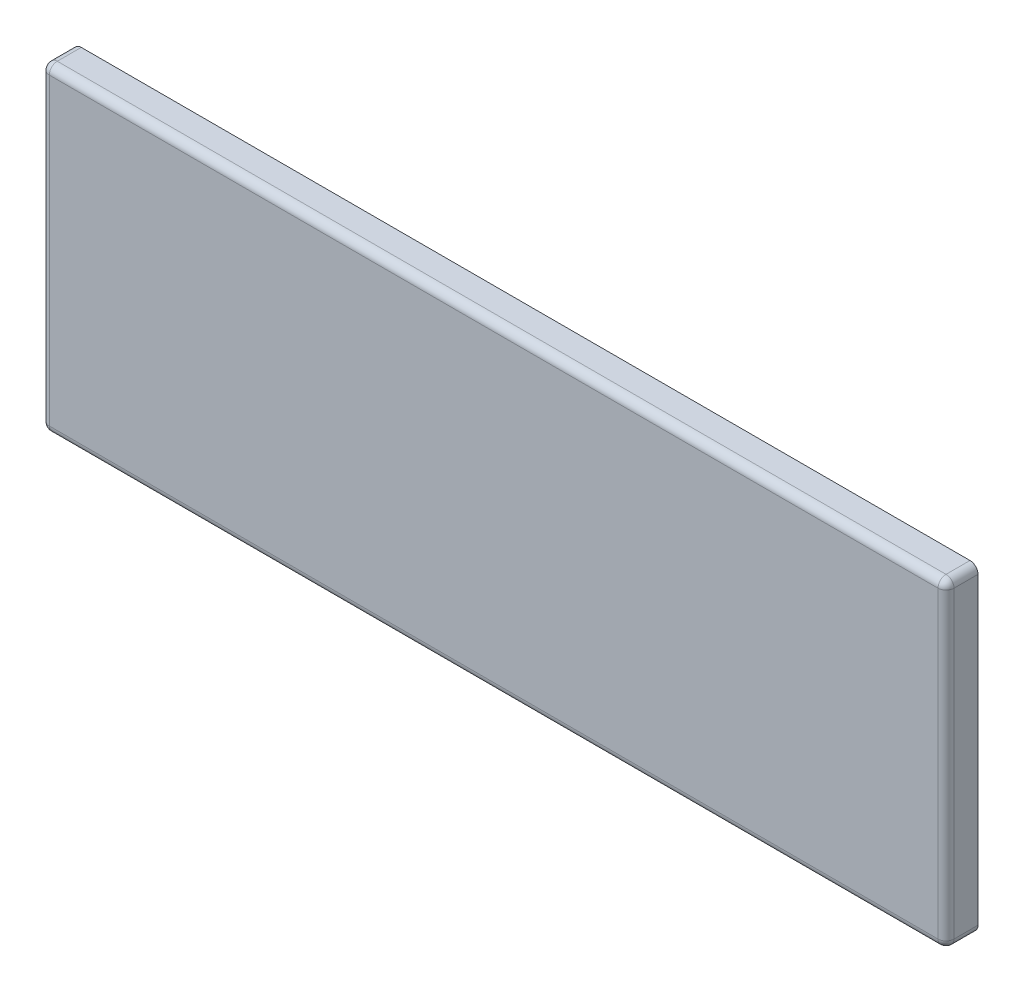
ISO-10303-21;
HEADER;
FILE_DESCRIPTION(('STEP AP214'),'2;1');
FILE_NAME('part.step','',(''),(''),'','','');
FILE_SCHEMA(('AUTOMOTIVE_DESIGN { 1 0 10303 214 1 1 1 1 }'));
ENDSEC;
DATA;
#1=APPLICATION_CONTEXT('core data for automotive mechanical design processes');
#2=APPLICATION_PROTOCOL_DEFINITION('international standard','automotive_design',2000,#1);
#3=PRODUCT_CONTEXT('',#1,'mechanical');
#4=PRODUCT('Part','Part','',(#3));
#5=PRODUCT_RELATED_PRODUCT_CATEGORY('part','',(#4));
#6=PRODUCT_DEFINITION_FORMATION('','',#4);
#7=PRODUCT_DEFINITION_CONTEXT('part definition',#1,'design');
#8=PRODUCT_DEFINITION('design','',#6,#7);
#9=PRODUCT_DEFINITION_SHAPE('','',#8);
#10=(LENGTH_UNIT() NAMED_UNIT(*) SI_UNIT(.MILLI.,.METRE.));
#11=(NAMED_UNIT(*) PLANE_ANGLE_UNIT() SI_UNIT($,.RADIAN.));
#12=(NAMED_UNIT(*) SI_UNIT($,.STERADIAN.) SOLID_ANGLE_UNIT());
#13=UNCERTAINTY_MEASURE_WITH_UNIT(LENGTH_MEASURE(1.E-05),#10,'distance_accuracy_value','');
#14=(GEOMETRIC_REPRESENTATION_CONTEXT(3) GLOBAL_UNCERTAINTY_ASSIGNED_CONTEXT((#13)) GLOBAL_UNIT_ASSIGNED_CONTEXT((#10,
#11,#12)) REPRESENTATION_CONTEXT('',''));
#15=CARTESIAN_POINT('',(0.,0.,0.));
#16=DIRECTION('',(0.,0.,1.));
#17=DIRECTION('',(1.,0.,0.));
#18=AXIS2_PLACEMENT_3D('',#15,#16,#17);
#19=CARTESIAN_POINT('',(56.57,-20.,4.));
#20=DIRECTION('',(-1.,0.,0.));
#21=DIRECTION('',(0.,0.,1.));
#22=AXIS2_PLACEMENT_3D('',#19,#20,#21);
#23=PLANE('',#22);
#24=DIRECTION('',(0.,1.,0.));
#25=VECTOR('',#24,1.);
#26=CARTESIAN_POINT('',(56.57,-20.,3.));
#27=LINE('',#26,#25);
#28=CARTESIAN_POINT('',(56.57,19.,3.));
#29=VERTEX_POINT('',#28);
#30=CARTESIAN_POINT('',(56.57,-19.,3.));
#31=VERTEX_POINT('',#30);
#32=EDGE_CURVE('E47',#29,#31,#27,.F.);
#33=ORIENTED_EDGE('',*,*,#32,.T.);
#34=DIRECTION('',(0.,0.,-1.));
#35=VECTOR('',#34,1.);
#36=CARTESIAN_POINT('',(56.57,-19.,4.));
#37=LINE('',#36,#35);
#38=CARTESIAN_POINT('',(56.57,-19.,0.));
#39=VERTEX_POINT('',#38);
#40=EDGE_CURVE('E166',#31,#39,#37,.T.);
#41=ORIENTED_EDGE('',*,*,#40,.T.);
#42=DIRECTION('',(0.,1.,0.));
#43=VECTOR('',#42,1.);
#44=CARTESIAN_POINT('',(56.57,-20.,0.));
#45=LINE('',#44,#43);
#46=CARTESIAN_POINT('',(56.57,19.,0.));
#47=VERTEX_POINT('',#46);
#48=EDGE_CURVE('E195',#39,#47,#45,.T.);
#49=ORIENTED_EDGE('',*,*,#48,.T.);
#50=DIRECTION('',(0.,0.,-1.));
#51=VECTOR('',#50,1.);
#52=CARTESIAN_POINT('',(56.57,19.,4.));
#53=LINE('',#52,#51);
#54=EDGE_CURVE('E52',#47,#29,#53,.F.);
#55=ORIENTED_EDGE('',*,*,#54,.T.);
#56=EDGE_LOOP('',(#33,#41,#49,#55));
#57=FACE_BOUND('',#56,.T.);
#58=ADVANCED_FACE('F30',(#57),#23,.F.);
#59=CARTESIAN_POINT('',(56.57,20.,4.));
#60=DIRECTION('',(0.,-1.,0.));
#61=DIRECTION('',(0.,0.,-1.));
#62=AXIS2_PLACEMENT_3D('',#59,#60,#61);
#63=PLANE('',#62);
#64=DIRECTION('',(-1.,0.,0.));
#65=VECTOR('',#64,1.);
#66=CARTESIAN_POINT('',(56.57,20.,0.));
#67=LINE('',#66,#65);
#68=CARTESIAN_POINT('',(55.57,20.,0.));
#69=VERTEX_POINT('',#68);
#70=CARTESIAN_POINT('',(-55.57,20.,0.));
#71=VERTEX_POINT('',#70);
#72=EDGE_CURVE('E197',#69,#71,#67,.T.);
#73=ORIENTED_EDGE('',*,*,#72,.T.);
#74=DIRECTION('',(0.,0.,-1.));
#75=VECTOR('',#74,1.);
#76=CARTESIAN_POINT('',(-55.57,20.,4.));
#77=LINE('',#76,#75);
#78=CARTESIAN_POINT('',(-55.57,20.,3.));
#79=VERTEX_POINT('',#78);
#80=EDGE_CURVE('E162',#71,#79,#77,.F.);
#81=ORIENTED_EDGE('',*,*,#80,.T.);
#82=DIRECTION('',(-1.,0.,0.));
#83=VECTOR('',#82,1.);
#84=CARTESIAN_POINT('',(56.57,20.,3.));
#85=LINE('',#84,#83);
#86=CARTESIAN_POINT('',(55.57,20.,3.));
#87=VERTEX_POINT('',#86);
#88=EDGE_CURVE('E160',#79,#87,#85,.F.);
#89=ORIENTED_EDGE('',*,*,#88,.T.);
#90=DIRECTION('',(0.,0.,-1.));
#91=VECTOR('',#90,1.);
#92=CARTESIAN_POINT('',(55.57,20.,4.));
#93=LINE('',#92,#91);
#94=EDGE_CURVE('E158',#87,#69,#93,.T.);
#95=ORIENTED_EDGE('',*,*,#94,.T.);
#96=EDGE_LOOP('',(#73,#81,#89,#95));
#97=FACE_BOUND('',#96,.T.);
#98=ADVANCED_FACE('F249',(#97),#63,.F.);
#99=CARTESIAN_POINT('',(-56.57,20.,4.));
#100=DIRECTION('',(1.,0.,0.));
#101=DIRECTION('',(0.,1.,0.));
#102=AXIS2_PLACEMENT_3D('',#99,#100,#101);
#103=PLANE('',#102);
#104=DIRECTION('',(0.,-1.,0.));
#105=VECTOR('',#104,1.);
#106=CARTESIAN_POINT('',(-56.57,20.,0.));
#107=LINE('',#106,#105);
#108=CARTESIAN_POINT('',(-56.57,19.,0.));
#109=VERTEX_POINT('',#108);
#110=CARTESIAN_POINT('',(-56.57,-19.,0.));
#111=VERTEX_POINT('',#110);
#112=EDGE_CURVE('E201',#109,#111,#107,.T.);
#113=ORIENTED_EDGE('',*,*,#112,.T.);
#114=DIRECTION('',(0.,0.,-1.));
#115=VECTOR('',#114,1.);
#116=CARTESIAN_POINT('',(-56.57,-19.,4.));
#117=LINE('',#116,#115);
#118=CARTESIAN_POINT('',(-56.57,-19.,3.));
#119=VERTEX_POINT('',#118);
#120=EDGE_CURVE('E156',#111,#119,#117,.F.);
#121=ORIENTED_EDGE('',*,*,#120,.T.);
#122=DIRECTION('',(0.,-1.,0.));
#123=VECTOR('',#122,1.);
#124=CARTESIAN_POINT('',(-56.57,20.,3.));
#125=LINE('',#124,#123);
#126=CARTESIAN_POINT('',(-56.57,19.,3.));
#127=VERTEX_POINT('',#126);
#128=EDGE_CURVE('E154',#119,#127,#125,.F.);
#129=ORIENTED_EDGE('',*,*,#128,.T.);
#130=DIRECTION('',(0.,0.,-1.));
#131=VECTOR('',#130,1.);
#132=CARTESIAN_POINT('',(-56.57,19.,4.));
#133=LINE('',#132,#131);
#134=EDGE_CURVE('E152',#127,#109,#133,.T.);
#135=ORIENTED_EDGE('',*,*,#134,.T.);
#136=EDGE_LOOP('',(#113,#121,#129,#135));
#137=FACE_BOUND('',#136,.T.);
#138=ADVANCED_FACE('F254',(#137),#103,.F.);
#139=CARTESIAN_POINT('',(56.57,-20.,4.));
#140=DIRECTION('',(0.,1.,0.));
#141=DIRECTION('',(0.,0.,1.));
#142=AXIS2_PLACEMENT_3D('',#139,#140,#141);
#143=PLANE('',#142);
#144=DIRECTION('',(1.,0.,0.));
#145=VECTOR('',#144,1.);
#146=CARTESIAN_POINT('',(56.57,-20.,0.));
#147=LINE('',#146,#145);
#148=CARTESIAN_POINT('',(-55.57,-20.,0.));
#149=VERTEX_POINT('',#148);
#150=CARTESIAN_POINT('',(55.57,-20.,0.));
#151=VERTEX_POINT('',#150);
#152=EDGE_CURVE('E137',#149,#151,#147,.T.);
#153=ORIENTED_EDGE('',*,*,#152,.T.);
#154=DIRECTION('',(0.,0.,-1.));
#155=VECTOR('',#154,1.);
#156=CARTESIAN_POINT('',(55.57,-20.,4.));
#157=LINE('',#156,#155);
#158=CARTESIAN_POINT('',(55.57,-20.,3.));
#159=VERTEX_POINT('',#158);
#160=EDGE_CURVE('E150',#151,#159,#157,.F.);
#161=ORIENTED_EDGE('',*,*,#160,.T.);
#162=DIRECTION('',(1.,0.,0.));
#163=VECTOR('',#162,1.);
#164=CARTESIAN_POINT('',(-56.57,-20.,3.));
#165=LINE('',#164,#163);
#166=CARTESIAN_POINT('',(-55.57,-20.,3.));
#167=VERTEX_POINT('',#166);
#168=EDGE_CURVE('E115',#159,#167,#165,.F.);
#169=ORIENTED_EDGE('',*,*,#168,.T.);
#170=DIRECTION('',(0.,0.,-1.));
#171=VECTOR('',#170,1.);
#172=CARTESIAN_POINT('',(-55.57,-20.,4.));
#173=LINE('',#172,#171);
#174=EDGE_CURVE('E143',#167,#149,#173,.T.);
#175=ORIENTED_EDGE('',*,*,#174,.T.);
#176=EDGE_LOOP('',(#153,#161,#169,#175));
#177=FACE_BOUND('',#176,.T.);
#178=ADVANCED_FACE('F226',(#177),#143,.F.);
#179=CARTESIAN_POINT('',(56.57,20.,4.));
#180=DIRECTION('',(0.,0.,1.));
#181=DIRECTION('',(1.,0.,0.));
#182=AXIS2_PLACEMENT_3D('',#179,#180,#181);
#183=PLANE('',#182);
#184=DIRECTION('',(0.,-1.,0.));
#185=VECTOR('',#184,1.);
#186=CARTESIAN_POINT('',(-55.57,-20.,4.));
#187=LINE('',#186,#185);
#188=CARTESIAN_POINT('',(-55.57,19.,4.));
#189=VERTEX_POINT('',#188);
#190=CARTESIAN_POINT('',(-55.57,-19.,4.));
#191=VERTEX_POINT('',#190);
#192=EDGE_CURVE('E141',#189,#191,#187,.T.);
#193=ORIENTED_EDGE('',*,*,#192,.T.);
#194=DIRECTION('',(1.,0.,0.));
#195=VECTOR('',#194,1.);
#196=CARTESIAN_POINT('',(56.57,-19.,4.));
#197=LINE('',#196,#195);
#198=CARTESIAN_POINT('',(55.57,-19.,4.));
#199=VERTEX_POINT('',#198);
#200=EDGE_CURVE('E113',#191,#199,#197,.T.);
#201=ORIENTED_EDGE('',*,*,#200,.T.);
#202=DIRECTION('',(0.,1.,0.));
#203=VECTOR('',#202,1.);
#204=CARTESIAN_POINT('',(55.57,20.,4.));
#205=LINE('',#204,#203);
#206=CARTESIAN_POINT('',(55.57,19.,4.));
#207=VERTEX_POINT('',#206);
#208=EDGE_CURVE('E130',#199,#207,#205,.T.);
#209=ORIENTED_EDGE('',*,*,#208,.T.);
#210=DIRECTION('',(-1.,0.,0.));
#211=VECTOR('',#210,1.);
#212=CARTESIAN_POINT('',(-56.57,19.,4.));
#213=LINE('',#212,#211);
#214=EDGE_CURVE('E136',#207,#189,#213,.T.);
#215=ORIENTED_EDGE('',*,*,#214,.T.);
#216=EDGE_LOOP('',(#193,#201,#209,#215));
#217=FACE_BOUND('',#216,.T.);
#218=ADVANCED_FACE('F139',(#217),#183,.T.);
#219=CARTESIAN_POINT('',(56.57,20.,0.));
#220=DIRECTION('',(0.,0.,1.));
#221=DIRECTION('',(1.,0.,0.));
#222=AXIS2_PLACEMENT_3D('',#219,#220,#221);
#223=PLANE('',#222);
#224=ORIENTED_EDGE('',*,*,#48,.F.);
#225=CARTESIAN_POINT('',(55.57,-19.,0.));
#226=DIRECTION('',(0.,0.,1.));
#227=DIRECTION('',(1.,0.,0.));
#228=AXIS2_PLACEMENT_3D('',#225,#226,#227);
#229=CIRCLE('',#228,1.);
#230=EDGE_CURVE('E11',#39,#151,#229,.F.);
#231=ORIENTED_EDGE('',*,*,#230,.T.);
#232=ORIENTED_EDGE('',*,*,#152,.F.);
#233=CARTESIAN_POINT('',(-55.57,-19.,0.));
#234=DIRECTION('',(0.,0.,1.));
#235=DIRECTION('',(1.,0.,0.));
#236=AXIS2_PLACEMENT_3D('',#233,#234,#235);
#237=CIRCLE('',#236,1.);
#238=EDGE_CURVE('E39',#149,#111,#237,.F.);
#239=ORIENTED_EDGE('',*,*,#238,.T.);
#240=ORIENTED_EDGE('',*,*,#112,.F.);
#241=CARTESIAN_POINT('',(-55.57,19.,0.));
#242=DIRECTION('',(0.,0.,1.));
#243=DIRECTION('',(1.,0.,0.));
#244=AXIS2_PLACEMENT_3D('',#241,#242,#243);
#245=CIRCLE('',#244,1.);
#246=EDGE_CURVE('E170',#109,#71,#245,.F.);
#247=ORIENTED_EDGE('',*,*,#246,.T.);
#248=ORIENTED_EDGE('',*,*,#72,.F.);
#249=CARTESIAN_POINT('',(55.57,19.,0.));
#250=DIRECTION('',(0.,0.,1.));
#251=DIRECTION('',(1.,0.,0.));
#252=AXIS2_PLACEMENT_3D('',#249,#250,#251);
#253=CIRCLE('',#252,1.);
#254=EDGE_CURVE('E168',#69,#47,#253,.F.);
#255=ORIENTED_EDGE('',*,*,#254,.T.);
#256=EDGE_LOOP('',(#224,#231,#232,#239,#240,#247,#248,#255));
#257=FACE_BOUND('',#256,.T.);
#258=ADVANCED_FACE('F232',(#257),#223,.F.);
#259=CARTESIAN_POINT('',(-55.57,19.,4.));
#260=DIRECTION('',(0.,0.,-1.));
#261=DIRECTION('',(-1.,0.,0.));
#262=AXIS2_PLACEMENT_3D('',#259,#260,#261);
#263=CYLINDRICAL_SURFACE('',#262,1.);
#264=ORIENTED_EDGE('',*,*,#246,.F.);
#265=ORIENTED_EDGE('',*,*,#134,.F.);
#266=CARTESIAN_POINT('',(-55.57,19.,3.));
#267=DIRECTION('',(0.,0.,1.));
#268=DIRECTION('',(1.,0.,0.));
#269=AXIS2_PLACEMENT_3D('',#266,#267,#268);
#270=CIRCLE('',#269,1.);
#271=EDGE_CURVE('E34',#79,#127,#270,.T.);
#272=ORIENTED_EDGE('',*,*,#271,.F.);
#273=ORIENTED_EDGE('',*,*,#80,.F.);
#274=EDGE_LOOP('',(#264,#265,#272,#273));
#275=FACE_BOUND('',#274,.T.);
#276=ADVANCED_FACE('F32',(#275),#263,.T.);
#277=CARTESIAN_POINT('',(56.57,19.,3.));
#278=DIRECTION('',(1.,0.,0.));
#279=DIRECTION('',(0.,0.,-1.));
#280=AXIS2_PLACEMENT_3D('',#277,#278,#279);
#281=CYLINDRICAL_SURFACE('',#280,1.);
#282=CARTESIAN_POINT('',(55.57,19.,3.));
#283=DIRECTION('',(1.,0.,0.));
#284=DIRECTION('',(0.,0.,-1.));
#285=AXIS2_PLACEMENT_3D('',#282,#283,#284);
#286=CIRCLE('',#285,1.);
#287=EDGE_CURVE('E187',#87,#207,#286,.T.);
#288=ORIENTED_EDGE('',*,*,#287,.F.);
#289=ORIENTED_EDGE('',*,*,#88,.F.);
#290=CARTESIAN_POINT('',(-55.57,19.,3.));
#291=DIRECTION('',(-1.,0.,0.));
#292=DIRECTION('',(0.,-1.,0.));
#293=AXIS2_PLACEMENT_3D('',#290,#291,#292);
#294=CIRCLE('',#293,1.);
#295=EDGE_CURVE('E189',#189,#79,#294,.T.);
#296=ORIENTED_EDGE('',*,*,#295,.F.);
#297=ORIENTED_EDGE('',*,*,#214,.F.);
#298=EDGE_LOOP('',(#288,#289,#296,#297));
#299=FACE_BOUND('',#298,.T.);
#300=ADVANCED_FACE('F210',(#299),#281,.T.);
#301=CARTESIAN_POINT('',(55.57,19.,4.));
#302=DIRECTION('',(0.,0.,-1.));
#303=DIRECTION('',(-1.,0.,0.));
#304=AXIS2_PLACEMENT_3D('',#301,#302,#303);
#305=CYLINDRICAL_SURFACE('',#304,1.);
#306=ORIENTED_EDGE('',*,*,#254,.F.);
#307=ORIENTED_EDGE('',*,*,#94,.F.);
#308=CARTESIAN_POINT('',(55.57,19.,3.));
#309=DIRECTION('',(0.,0.,1.));
#310=DIRECTION('',(1.,0.,0.));
#311=AXIS2_PLACEMENT_3D('',#308,#309,#310);
#312=CIRCLE('',#311,1.);
#313=EDGE_CURVE('E184',#29,#87,#312,.T.);
#314=ORIENTED_EDGE('',*,*,#313,.F.);
#315=ORIENTED_EDGE('',*,*,#54,.F.);
#316=EDGE_LOOP('',(#306,#307,#314,#315));
#317=FACE_BOUND('',#316,.T.);
#318=ADVANCED_FACE('F237',(#317),#305,.T.);
#319=CARTESIAN_POINT('',(-55.57,19.,3.));
#320=DIRECTION('',(0.,0.,1.));
#321=DIRECTION('',(1.,0.,0.));
#322=AXIS2_PLACEMENT_3D('',#319,#320,#321);
#323=SPHERICAL_SURFACE('',#322,1.);
#324=ORIENTED_EDGE('',*,*,#295,.T.);
#325=ORIENTED_EDGE('',*,*,#271,.T.);
#326=CARTESIAN_POINT('',(-55.57,19.,3.));
#327=DIRECTION('',(0.,1.,0.));
#328=DIRECTION('',(0.,0.,1.));
#329=AXIS2_PLACEMENT_3D('',#326,#327,#328);
#330=CIRCLE('',#329,1.);
#331=EDGE_CURVE('E181',#189,#127,#330,.F.);
#332=ORIENTED_EDGE('',*,*,#331,.F.);
#333=EDGE_LOOP('',(#324,#325,#332));
#334=FACE_BOUND('',#333,.T.);
#335=ADVANCED_FACE('F211',(#334),#323,.T.);
#336=CARTESIAN_POINT('',(55.57,19.,3.));
#337=DIRECTION('',(0.,0.,1.));
#338=DIRECTION('',(1.,0.,0.));
#339=AXIS2_PLACEMENT_3D('',#336,#337,#338);
#340=SPHERICAL_SURFACE('',#339,1.);
#341=ORIENTED_EDGE('',*,*,#313,.T.);
#342=ORIENTED_EDGE('',*,*,#287,.T.);
#343=CARTESIAN_POINT('',(55.57,19.,3.));
#344=DIRECTION('',(0.,1.,0.));
#345=DIRECTION('',(0.,0.,1.));
#346=AXIS2_PLACEMENT_3D('',#343,#344,#345);
#347=CIRCLE('',#346,1.);
#348=EDGE_CURVE('E133',#29,#207,#347,.F.);
#349=ORIENTED_EDGE('',*,*,#348,.F.);
#350=EDGE_LOOP('',(#341,#342,#349));
#351=FACE_BOUND('',#350,.T.);
#352=ADVANCED_FACE('F239',(#351),#340,.T.);
#353=CARTESIAN_POINT('',(-55.57,-19.,4.));
#354=DIRECTION('',(0.,0.,-1.));
#355=DIRECTION('',(-1.,0.,0.));
#356=AXIS2_PLACEMENT_3D('',#353,#354,#355);
#357=CYLINDRICAL_SURFACE('',#356,1.);
#358=ORIENTED_EDGE('',*,*,#238,.F.);
#359=ORIENTED_EDGE('',*,*,#174,.F.);
#360=CARTESIAN_POINT('',(-55.57,-19.,3.));
#361=DIRECTION('',(0.,0.,1.));
#362=DIRECTION('',(1.,0.,0.));
#363=AXIS2_PLACEMENT_3D('',#360,#361,#362);
#364=CIRCLE('',#363,1.);
#365=EDGE_CURVE('E177',#119,#167,#364,.T.);
#366=ORIENTED_EDGE('',*,*,#365,.F.);
#367=ORIENTED_EDGE('',*,*,#120,.F.);
#368=EDGE_LOOP('',(#358,#359,#366,#367));
#369=FACE_BOUND('',#368,.T.);
#370=ADVANCED_FACE('F223',(#369),#357,.T.);
#371=CARTESIAN_POINT('',(-55.57,20.,3.));
#372=DIRECTION('',(0.,1.,0.));
#373=DIRECTION('',(-1.,0.,0.));
#374=AXIS2_PLACEMENT_3D('',#371,#372,#373);
#375=CYLINDRICAL_SURFACE('',#374,1.);
#376=ORIENTED_EDGE('',*,*,#331,.T.);
#377=ORIENTED_EDGE('',*,*,#128,.F.);
#378=CARTESIAN_POINT('',(-55.57,-19.,3.));
#379=DIRECTION('',(0.,-1.,0.));
#380=DIRECTION('',(0.,0.,-1.));
#381=AXIS2_PLACEMENT_3D('',#378,#379,#380);
#382=CIRCLE('',#381,1.);
#383=EDGE_CURVE('E127',#191,#119,#382,.T.);
#384=ORIENTED_EDGE('',*,*,#383,.F.);
#385=ORIENTED_EDGE('',*,*,#192,.F.);
#386=EDGE_LOOP('',(#376,#377,#384,#385));
#387=FACE_BOUND('',#386,.T.);
#388=ADVANCED_FACE('F214',(#387),#375,.T.);
#389=CARTESIAN_POINT('',(55.57,20.,3.));
#390=DIRECTION('',(0.,-1.,0.));
#391=DIRECTION('',(0.,0.,-1.));
#392=AXIS2_PLACEMENT_3D('',#389,#390,#391);
#393=CYLINDRICAL_SURFACE('',#392,1.);
#394=ORIENTED_EDGE('',*,*,#348,.T.);
#395=ORIENTED_EDGE('',*,*,#208,.F.);
#396=CARTESIAN_POINT('',(55.57,-19.,3.));
#397=DIRECTION('',(0.,-1.,0.));
#398=DIRECTION('',(0.,0.,-1.));
#399=AXIS2_PLACEMENT_3D('',#396,#397,#398);
#400=CIRCLE('',#399,1.);
#401=EDGE_CURVE('E121',#31,#199,#400,.T.);
#402=ORIENTED_EDGE('',*,*,#401,.F.);
#403=ORIENTED_EDGE('',*,*,#32,.F.);
#404=EDGE_LOOP('',(#394,#395,#402,#403));
#405=FACE_BOUND('',#404,.T.);
#406=ADVANCED_FACE('F131',(#405),#393,.T.);
#407=CARTESIAN_POINT('',(55.57,-19.,4.));
#408=DIRECTION('',(0.,0.,-1.));
#409=DIRECTION('',(-1.,0.,0.));
#410=AXIS2_PLACEMENT_3D('',#407,#408,#409);
#411=CYLINDRICAL_SURFACE('',#410,1.);
#412=ORIENTED_EDGE('',*,*,#230,.F.);
#413=ORIENTED_EDGE('',*,*,#40,.F.);
#414=CARTESIAN_POINT('',(55.57,-19.,3.));
#415=DIRECTION('',(0.,0.,1.));
#416=DIRECTION('',(1.,0.,0.));
#417=AXIS2_PLACEMENT_3D('',#414,#415,#416);
#418=CIRCLE('',#417,1.);
#419=EDGE_CURVE('E125',#159,#31,#418,.T.);
#420=ORIENTED_EDGE('',*,*,#419,.F.);
#421=ORIENTED_EDGE('',*,*,#160,.F.);
#422=EDGE_LOOP('',(#412,#413,#420,#421));
#423=FACE_BOUND('',#422,.T.);
#424=ADVANCED_FACE('F230',(#423),#411,.T.);
#425=CARTESIAN_POINT('',(-55.57,-19.,3.));
#426=DIRECTION('',(0.,0.,1.));
#427=DIRECTION('',(1.,0.,0.));
#428=AXIS2_PLACEMENT_3D('',#425,#426,#427);
#429=SPHERICAL_SURFACE('',#428,1.);
#430=ORIENTED_EDGE('',*,*,#383,.T.);
#431=ORIENTED_EDGE('',*,*,#365,.T.);
#432=CARTESIAN_POINT('',(-55.57,-19.,3.));
#433=DIRECTION('',(-1.,0.,0.));
#434=DIRECTION('',(0.,0.,1.));
#435=AXIS2_PLACEMENT_3D('',#432,#433,#434);
#436=CIRCLE('',#435,1.);
#437=EDGE_CURVE('E118',#191,#167,#436,.F.);
#438=ORIENTED_EDGE('',*,*,#437,.F.);
#439=EDGE_LOOP('',(#430,#431,#438));
#440=FACE_BOUND('',#439,.T.);
#441=ADVANCED_FACE('F218',(#440),#429,.T.);
#442=CARTESIAN_POINT('',(55.57,-19.,3.));
#443=DIRECTION('',(0.,0.,1.));
#444=DIRECTION('',(1.,0.,0.));
#445=AXIS2_PLACEMENT_3D('',#442,#443,#444);
#446=SPHERICAL_SURFACE('',#445,1.);
#447=ORIENTED_EDGE('',*,*,#419,.T.);
#448=ORIENTED_EDGE('',*,*,#401,.T.);
#449=CARTESIAN_POINT('',(55.57,-19.,3.));
#450=DIRECTION('',(1.,0.,0.));
#451=DIRECTION('',(0.,0.,-1.));
#452=AXIS2_PLACEMENT_3D('',#449,#450,#451);
#453=CIRCLE('',#452,1.);
#454=EDGE_CURVE('E109',#159,#199,#453,.F.);
#455=ORIENTED_EDGE('',*,*,#454,.F.);
#456=EDGE_LOOP('',(#447,#448,#455));
#457=FACE_BOUND('',#456,.T.);
#458=ADVANCED_FACE('F123',(#457),#446,.T.);
#459=CARTESIAN_POINT('',(56.57,-19.,3.));
#460=DIRECTION('',(-1.,0.,0.));
#461=DIRECTION('',(0.,0.,1.));
#462=AXIS2_PLACEMENT_3D('',#459,#460,#461);
#463=CYLINDRICAL_SURFACE('',#462,1.);
#464=ORIENTED_EDGE('',*,*,#437,.T.);
#465=ORIENTED_EDGE('',*,*,#168,.F.);
#466=ORIENTED_EDGE('',*,*,#454,.T.);
#467=ORIENTED_EDGE('',*,*,#200,.F.);
#468=EDGE_LOOP('',(#464,#465,#466,#467));
#469=FACE_BOUND('',#468,.T.);
#470=ADVANCED_FACE('F111',(#469),#463,.T.);
#471=CLOSED_SHELL('',(#58,#98,#138,#178,#218,#258,#276,#300,#318,#335,#352,#370,#388,#406,#424,
#441,#458,#470));
#472=MANIFOLD_SOLID_BREP('B2',#471);
#473=ADVANCED_BREP_SHAPE_REPRESENTATION('',(#18,#472),#14);
#474=SHAPE_DEFINITION_REPRESENTATION(#9,#473);
ENDSEC;
END-ISO-10303-21;
